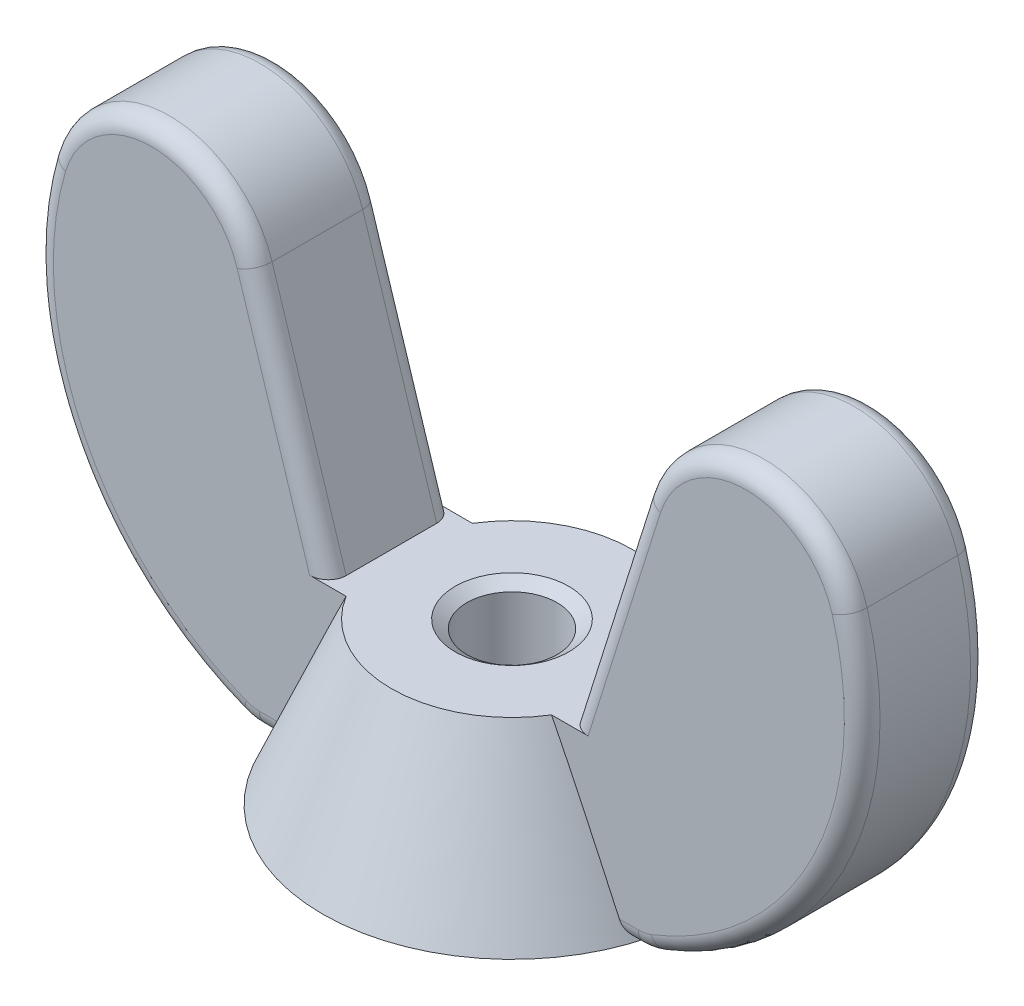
from build123d import *

# Parameters (mm, degrees)
WING_DEPTH    = 1.397
BOSSHOLESKE_W = 0.99695
BOSSHOLESKE_H = 3.556
WINGFILLET_R  = 0.395111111


with BuildPart() as part:
    # WingSke → Wing (new, symmetric)
    with BuildSketch(Plane.XY):
        with BuildLine():
            Line((-2.667, 3.556), (2.667, 3.556))
            Line((2.667, 3.556), (4.304700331, 8.750121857))
            ThreePointArc((4.304700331, 8.750121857), (6.598446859, 10.413873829), (8.857441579, 8.703234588))
            ThreePointArc((8.857441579, 8.703234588), (8.415588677, 3.569425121), (4.6228, 0.081447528))
            ThreePointArc((4.6228, 0.081447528), (4.410707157, 0.020539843), (4.191, 0))
            Line((4.191, 0), (-4.191, 0))
            ThreePointArc((-4.191, 0), (-4.410707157, 0.020539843), (-4.6228, 0.081447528))
            ThreePointArc((-4.6228, 0.081447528), (-8.415588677, 3.569425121), (-8.857441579, 8.703234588))
            ThreePointArc((-8.857441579, 8.703234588), (-6.598446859, 10.413873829), (-4.304700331, 8.750121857))
            Line((-4.304700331, 8.750121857), (-2.667, 3.556))
        make_face()
    extrude(amount=WING_DEPTH, both=True)

    # BossSke → Boss (revolve)
    with BuildSketch(Plane.XY):
        Polygon((-2.667, 3.556), (-4.191, 0), (0, 0), (0, 3.556), align=None)
    revolve(axis=Axis((0, 0, 0), (0, 1, 0)))

    # BossHoleSke → BossHole (revolve, cut)
    with BuildSketch(Plane.XY):
        with Locations((0.498475, 1.778)):
            Rectangle(BOSSHOLESKE_W, BOSSHOLESKE_H)
    revolve(axis=Axis((0, 3.556, 0), (0, 1, 0)), mode=Mode.SUBTRACT)

    # Sketch7 → Cut-Revolve2 (revolve, cut)
    with BuildSketch(Plane.XY, mode=Mode.PRIVATE) as cut_revolve2_sk:
        Polygon((0.99695, 3.373700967), (1.2573, 3.556), (0.99695, 3.556), align=None)
        Polygon((0.99695, 0.182299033), (0.99695, 0), (1.2573, 0), align=None)
    revolve(cut_revolve2_sk.sketch.rotate(Axis((0, 62.750365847, 0), (0, -1, 0)), 180), axis=Axis((0, 62.750365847, 0), (0, -1, 0)), mode=Mode.SUBTRACT)

    # WingFillet
    wingfillet_edges = [part.edges().sort_by_distance(p)[0] for p in [
        (4.071156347, 0, -1.397),
        (4.410707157, 0.020539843, -1.397),
        (8.415588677, 3.569425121, -1.397),
        (6.598446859, 10.413873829, -1.397),
        (-4.071156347, 0, -1.397),
        (-4.410707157, 0.020539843, -1.397),
        (-8.415588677, 3.569425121, -1.397),
        (-6.598446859, 10.413873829, -1.397),
        (4.071156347, 0, 1.397),
        (4.410707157, 0.020539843, 1.397),
        (8.415588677, 3.569425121, 1.397),
        (6.598446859, 10.413873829, 1.397),
        (-4.071156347, 0, 1.397),
        (-4.410707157, 0.020539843, 1.397),
        (-8.415588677, 3.569425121, 1.397),
        (-6.598446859, 10.413873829, 1.397),
        (3.485850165, 6.153060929, -1.397),
        (-3.485850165, 6.153060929, -1.397),
        (3.485850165, 6.153060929, 1.397),
        (-3.485850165, 6.153060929, 1.397),
    ]]
    fillet(wingfillet_edges, radius=WINGFILLET_R)


solid = part.part
